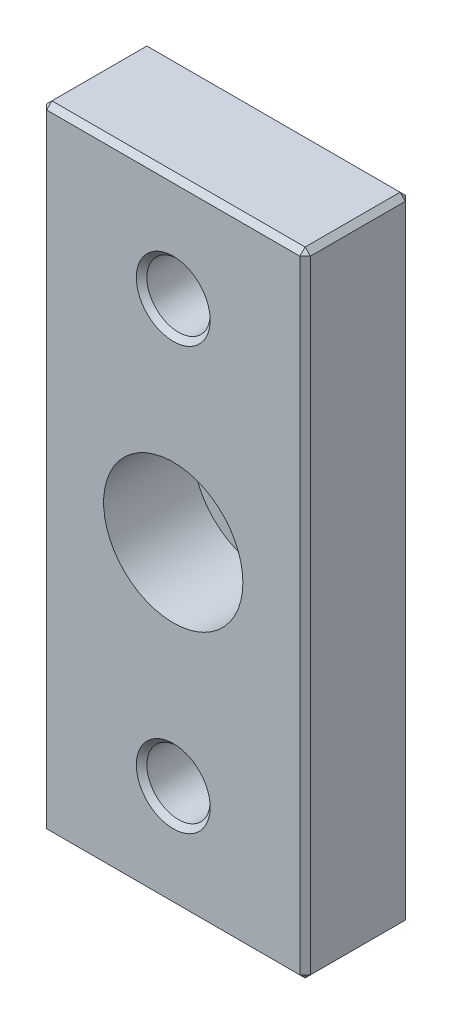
ISO-10303-21;
HEADER;
FILE_DESCRIPTION(('STEP AP214'),'2;1');
FILE_NAME('part.step','',(''),(''),'','','');
FILE_SCHEMA(('AUTOMOTIVE_DESIGN { 1 0 10303 214 1 1 1 1 }'));
ENDSEC;
DATA;
#1=APPLICATION_CONTEXT('core data for automotive mechanical design processes');
#2=APPLICATION_PROTOCOL_DEFINITION('international standard','automotive_design',2000,#1);
#3=PRODUCT_CONTEXT('',#1,'mechanical');
#4=PRODUCT('Part','Part','',(#3));
#5=PRODUCT_RELATED_PRODUCT_CATEGORY('part','',(#4));
#6=PRODUCT_DEFINITION_FORMATION('','',#4);
#7=PRODUCT_DEFINITION_CONTEXT('part definition',#1,'design');
#8=PRODUCT_DEFINITION('design','',#6,#7);
#9=PRODUCT_DEFINITION_SHAPE('','',#8);
#10=(LENGTH_UNIT() NAMED_UNIT(*) SI_UNIT(.MILLI.,.METRE.));
#11=(NAMED_UNIT(*) PLANE_ANGLE_UNIT() SI_UNIT($,.RADIAN.));
#12=(NAMED_UNIT(*) SI_UNIT($,.STERADIAN.) SOLID_ANGLE_UNIT());
#13=UNCERTAINTY_MEASURE_WITH_UNIT(LENGTH_MEASURE(1.E-05),#10,'distance_accuracy_value','');
#14=(GEOMETRIC_REPRESENTATION_CONTEXT(3) GLOBAL_UNCERTAINTY_ASSIGNED_CONTEXT((#13)) GLOBAL_UNIT_ASSIGNED_CONTEXT((#10,
#11,#12)) REPRESENTATION_CONTEXT('',''));
#15=CARTESIAN_POINT('',(0.,0.,0.));
#16=DIRECTION('',(0.,0.,1.));
#17=DIRECTION('',(1.,0.,0.));
#18=AXIS2_PLACEMENT_3D('',#15,#16,#17);
#19=CARTESIAN_POINT('',(12.5,30.,10.));
#20=DIRECTION('',(0.,0.,-1.));
#21=DIRECTION('',(-1.,0.,0.));
#22=AXIS2_PLACEMENT_3D('',#19,#20,#21);
#23=CYLINDRICAL_SURFACE('',#22,4.1);
#24=CARTESIAN_POINT('',(12.5,30.,0.));
#25=DIRECTION('',(0.,0.,1.));
#26=DIRECTION('',(1.,0.,0.));
#27=AXIS2_PLACEMENT_3D('',#24,#25,#26);
#28=CIRCLE('',#27,4.1);
#29=CARTESIAN_POINT('',(16.6,30.,0.));
#30=VERTEX_POINT('',#29);
#31=EDGE_CURVE('E198',#30,#30,#28,.T.);
#32=ORIENTED_EDGE('',*,*,#31,.F.);
#33=EDGE_LOOP('',(#32));
#34=FACE_BOUND('',#33,.T.);
#35=CARTESIAN_POINT('',(12.5,30.,1.5));
#36=DIRECTION('',(0.,0.,1.));
#37=DIRECTION('',(1.,0.,0.));
#38=AXIS2_PLACEMENT_3D('',#35,#36,#37);
#39=CIRCLE('',#38,4.1);
#40=CARTESIAN_POINT('',(16.6,30.,1.5));
#41=VERTEX_POINT('',#40);
#42=EDGE_CURVE('E35',#41,#41,#39,.T.);
#43=ORIENTED_EDGE('',*,*,#42,.T.);
#44=EDGE_LOOP('',(#43));
#45=FACE_BOUND('',#44,.T.);
#46=ADVANCED_FACE('F31',(#34,#45),#23,.F.);
#47=CARTESIAN_POINT('',(0.,60.,10.));
#48=DIRECTION('',(0.,0.,1.));
#49=DIRECTION('',(1.,0.,0.));
#50=AXIS2_PLACEMENT_3D('',#47,#48,#49);
#51=PLANE('',#50);
#52=CARTESIAN_POINT('',(12.5,30.,10.));
#53=DIRECTION('',(0.,0.,1.));
#54=DIRECTION('',(1.,0.,0.));
#55=AXIS2_PLACEMENT_3D('',#52,#53,#54);
#56=CIRCLE('',#55,6.6);
#57=CARTESIAN_POINT('',(19.1,30.,10.));
#58=VERTEX_POINT('',#57);
#59=EDGE_CURVE('E358',#58,#58,#56,.T.);
#60=ORIENTED_EDGE('',*,*,#59,.F.);
#61=EDGE_LOOP('',(#60));
#62=FACE_BOUND('',#61,.T.);
#63=CARTESIAN_POINT('',(12.5,50.,10.));
#64=DIRECTION('',(0.,0.,1.));
#65=DIRECTION('',(1.,0.,0.));
#66=AXIS2_PLACEMENT_3D('',#63,#64,#65);
#67=CIRCLE('',#66,3.5);
#68=CARTESIAN_POINT('',(16.,50.,10.));
#69=VERTEX_POINT('',#68);
#70=EDGE_CURVE('E252',#69,#69,#67,.F.);
#71=ORIENTED_EDGE('',*,*,#70,.T.);
#72=EDGE_LOOP('',(#71));
#73=FACE_BOUND('',#72,.T.);
#74=DIRECTION('',(0.,1.,0.));
#75=VECTOR('',#74,1.);
#76=CARTESIAN_POINT('',(24.5,60.,10.));
#77=LINE('',#76,#75);
#78=CARTESIAN_POINT('',(24.5,0.500000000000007,10.));
#79=VERTEX_POINT('',#78);
#80=CARTESIAN_POINT('',(24.5,59.5,10.));
#81=VERTEX_POINT('',#80);
#82=EDGE_CURVE('E47',#79,#81,#77,.T.);
#83=ORIENTED_EDGE('',*,*,#82,.T.);
#84=DIRECTION('',(-1.,0.,0.));
#85=VECTOR('',#84,1.);
#86=CARTESIAN_POINT('',(0.,59.5,10.));
#87=LINE('',#86,#85);
#88=CARTESIAN_POINT('',(0.500000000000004,59.5,10.));
#89=VERTEX_POINT('',#88);
#90=EDGE_CURVE('E250',#81,#89,#87,.T.);
#91=ORIENTED_EDGE('',*,*,#90,.T.);
#92=DIRECTION('',(0.,-1.,0.));
#93=VECTOR('',#92,1.);
#94=CARTESIAN_POINT('',(0.500000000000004,60.,10.));
#95=LINE('',#94,#93);
#96=CARTESIAN_POINT('',(0.500000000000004,0.500000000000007,10.));
#97=VERTEX_POINT('',#96);
#98=EDGE_CURVE('E246',#89,#97,#95,.T.);
#99=ORIENTED_EDGE('',*,*,#98,.T.);
#100=DIRECTION('',(1.,0.,0.));
#101=VECTOR('',#100,1.);
#102=CARTESIAN_POINT('',(25.,0.500000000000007,10.));
#103=LINE('',#102,#101);
#104=EDGE_CURVE('E52',#97,#79,#103,.T.);
#105=ORIENTED_EDGE('',*,*,#104,.T.);
#106=EDGE_LOOP('',(#83,#91,#99,#105));
#107=FACE_BOUND('',#106,.T.);
#108=CARTESIAN_POINT('',(12.5,9.99999999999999,10.));
#109=DIRECTION('',(0.,0.,1.));
#110=DIRECTION('',(1.,0.,0.));
#111=AXIS2_PLACEMENT_3D('',#108,#109,#110);
#112=CIRCLE('',#111,3.5);
#113=CARTESIAN_POINT('',(16.,9.99999999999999,10.));
#114=VERTEX_POINT('',#113);
#115=EDGE_CURVE('E243',#114,#114,#112,.F.);
#116=ORIENTED_EDGE('',*,*,#115,.T.);
#117=EDGE_LOOP('',(#116));
#118=FACE_BOUND('',#117,.T.);
#119=ADVANCED_FACE('F280',(#62,#73,#107,#118),#51,.T.);
#120=CARTESIAN_POINT('',(0.,60.,0.));
#121=DIRECTION('',(0.,0.,1.));
#122=DIRECTION('',(1.,0.,0.));
#123=AXIS2_PLACEMENT_3D('',#120,#121,#122);
#124=PLANE('',#123);
#125=DIRECTION('',(0.,-1.,0.));
#126=VECTOR('',#125,1.);
#127=CARTESIAN_POINT('',(24.5,0.,0.));
#128=LINE('',#127,#126);
#129=CARTESIAN_POINT('',(24.5,59.5,0.));
#130=VERTEX_POINT('',#129);
#131=CARTESIAN_POINT('',(24.5,0.5,0.));
#132=VERTEX_POINT('',#131);
#133=EDGE_CURVE('E210',#130,#132,#128,.T.);
#134=ORIENTED_EDGE('',*,*,#133,.T.);
#135=DIRECTION('',(-1.,0.,0.));
#136=VECTOR('',#135,1.);
#137=CARTESIAN_POINT('',(0.,0.5,0.));
#138=LINE('',#137,#136);
#139=CARTESIAN_POINT('',(0.500000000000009,0.5,0.));
#140=VERTEX_POINT('',#139);
#141=EDGE_CURVE('E214',#132,#140,#138,.T.);
#142=ORIENTED_EDGE('',*,*,#141,.T.);
#143=DIRECTION('',(0.,1.,0.));
#144=VECTOR('',#143,1.);
#145=CARTESIAN_POINT('',(0.500000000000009,60.,0.));
#146=LINE('',#145,#144);
#147=CARTESIAN_POINT('',(0.500000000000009,59.5,0.));
#148=VERTEX_POINT('',#147);
#149=EDGE_CURVE('E212',#140,#148,#146,.T.);
#150=ORIENTED_EDGE('',*,*,#149,.T.);
#151=DIRECTION('',(1.,0.,0.));
#152=VECTOR('',#151,1.);
#153=CARTESIAN_POINT('',(0.,59.5,0.));
#154=LINE('',#153,#152);
#155=EDGE_CURVE('E208',#148,#130,#154,.T.);
#156=ORIENTED_EDGE('',*,*,#155,.T.);
#157=EDGE_LOOP('',(#134,#142,#150,#156));
#158=FACE_BOUND('',#157,.T.);
#159=CARTESIAN_POINT('',(12.5,9.99999999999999,0.));
#160=DIRECTION('',(0.,0.,1.));
#161=DIRECTION('',(1.,0.,0.));
#162=AXIS2_PLACEMENT_3D('',#159,#160,#161);
#163=CIRCLE('',#162,3.);
#164=CARTESIAN_POINT('',(15.5,9.99999999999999,0.));
#165=VERTEX_POINT('',#164);
#166=EDGE_CURVE('E201',#165,#165,#163,.T.);
#167=ORIENTED_EDGE('',*,*,#166,.T.);
#168=EDGE_LOOP('',(#167));
#169=FACE_BOUND('',#168,.T.);
#170=CARTESIAN_POINT('',(12.5,50.,0.));
#171=DIRECTION('',(0.,0.,1.));
#172=DIRECTION('',(1.,0.,0.));
#173=AXIS2_PLACEMENT_3D('',#170,#171,#172);
#174=CIRCLE('',#173,3.);
#175=CARTESIAN_POINT('',(15.5,50.,0.));
#176=VERTEX_POINT('',#175);
#177=EDGE_CURVE('E140',#176,#176,#174,.T.);
#178=ORIENTED_EDGE('',*,*,#177,.T.);
#179=EDGE_LOOP('',(#178));
#180=FACE_BOUND('',#179,.T.);
#181=ORIENTED_EDGE('',*,*,#31,.T.);
#182=EDGE_LOOP('',(#181));
#183=FACE_BOUND('',#182,.T.);
#184=ADVANCED_FACE('F286',(#158,#169,#180,#183),#124,.F.);
#185=CARTESIAN_POINT('',(0.,0.,10.));
#186=DIRECTION('',(-1.,0.,0.));
#187=DIRECTION('',(0.,0.,1.));
#188=AXIS2_PLACEMENT_3D('',#185,#186,#187);
#189=PLANE('',#188);
#190=DIRECTION('',(0.,0.,-1.));
#191=VECTOR('',#190,1.);
#192=CARTESIAN_POINT('',(0.,59.5,0.));
#193=LINE('',#192,#191);
#194=CARTESIAN_POINT('',(0.,59.5,9.49999999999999));
#195=VERTEX_POINT('',#194);
#196=CARTESIAN_POINT('',(0.,59.5,0.500000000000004));
#197=VERTEX_POINT('',#196);
#198=EDGE_CURVE('E221',#195,#197,#193,.T.);
#199=ORIENTED_EDGE('',*,*,#198,.T.);
#200=DIRECTION('',(0.,-1.,0.));
#201=VECTOR('',#200,1.);
#202=CARTESIAN_POINT('',(0.,0.,0.500000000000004));
#203=LINE('',#202,#201);
#204=CARTESIAN_POINT('',(0.,0.500000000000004,0.500000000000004));
#205=VERTEX_POINT('',#204);
#206=EDGE_CURVE('E223',#197,#205,#203,.T.);
#207=ORIENTED_EDGE('',*,*,#206,.T.);
#208=DIRECTION('',(0.,0.,1.));
#209=VECTOR('',#208,1.);
#210=CARTESIAN_POINT('',(0.,0.500000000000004,10.));
#211=LINE('',#210,#209);
#212=CARTESIAN_POINT('',(0.,0.500000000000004,9.49999999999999));
#213=VERTEX_POINT('',#212);
#214=EDGE_CURVE('E219',#205,#213,#211,.T.);
#215=ORIENTED_EDGE('',*,*,#214,.T.);
#216=DIRECTION('',(0.,1.,0.));
#217=VECTOR('',#216,1.);
#218=CARTESIAN_POINT('',(0.,0.,9.49999999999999));
#219=LINE('',#218,#217);
#220=EDGE_CURVE('E217',#213,#195,#219,.T.);
#221=ORIENTED_EDGE('',*,*,#220,.T.);
#222=EDGE_LOOP('',(#199,#207,#215,#221));
#223=FACE_BOUND('',#222,.T.);
#224=ADVANCED_FACE('F303',(#223),#189,.T.);
#225=CARTESIAN_POINT('',(0.,0.,10.));
#226=DIRECTION('',(0.,1.,0.));
#227=DIRECTION('',(0.,0.,1.));
#228=AXIS2_PLACEMENT_3D('',#225,#226,#227);
#229=PLANE('',#228);
#230=DIRECTION('',(0.,0.,-1.));
#231=VECTOR('',#230,1.);
#232=CARTESIAN_POINT('',(0.500000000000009,0.,0.));
#233=LINE('',#232,#231);
#234=CARTESIAN_POINT('',(0.500000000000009,0.,9.5));
#235=VERTEX_POINT('',#234);
#236=CARTESIAN_POINT('',(0.500000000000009,0.,0.500000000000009));
#237=VERTEX_POINT('',#236);
#238=EDGE_CURVE('E129',#235,#237,#233,.T.);
#239=ORIENTED_EDGE('',*,*,#238,.T.);
#240=DIRECTION('',(1.,0.,0.));
#241=VECTOR('',#240,1.);
#242=CARTESIAN_POINT('',(0.,0.,0.500000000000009));
#243=LINE('',#242,#241);
#244=CARTESIAN_POINT('',(24.5,0.,0.500000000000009));
#245=VERTEX_POINT('',#244);
#246=EDGE_CURVE('E125',#237,#245,#243,.T.);
#247=ORIENTED_EDGE('',*,*,#246,.T.);
#248=DIRECTION('',(0.,0.,1.));
#249=VECTOR('',#248,1.);
#250=CARTESIAN_POINT('',(24.5,0.,10.));
#251=LINE('',#250,#249);
#252=CARTESIAN_POINT('',(24.5,0.,9.5));
#253=VERTEX_POINT('',#252);
#254=EDGE_CURVE('E120',#245,#253,#251,.T.);
#255=ORIENTED_EDGE('',*,*,#254,.T.);
#256=DIRECTION('',(-1.,0.,0.));
#257=VECTOR('',#256,1.);
#258=CARTESIAN_POINT('',(0.,0.,9.5));
#259=LINE('',#258,#257);
#260=EDGE_CURVE('E122',#253,#235,#259,.T.);
#261=ORIENTED_EDGE('',*,*,#260,.T.);
#262=EDGE_LOOP('',(#239,#247,#255,#261));
#263=FACE_BOUND('',#262,.T.);
#264=ADVANCED_FACE('F33',(#263),#229,.F.);
#265=CARTESIAN_POINT('',(25.,60.,10.));
#266=DIRECTION('',(1.,0.,0.));
#267=DIRECTION('',(0.,1.,0.));
#268=AXIS2_PLACEMENT_3D('',#265,#266,#267);
#269=PLANE('',#268);
#270=DIRECTION('',(0.,0.,-1.));
#271=VECTOR('',#270,1.);
#272=CARTESIAN_POINT('',(25.,0.500000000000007,0.));
#273=LINE('',#272,#271);
#274=CARTESIAN_POINT('',(25.,0.500000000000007,9.49999999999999));
#275=VERTEX_POINT('',#274);
#276=CARTESIAN_POINT('',(25.,0.500000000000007,0.500000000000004));
#277=VERTEX_POINT('',#276);
#278=EDGE_CURVE('E151',#275,#277,#273,.T.);
#279=ORIENTED_EDGE('',*,*,#278,.T.);
#280=DIRECTION('',(0.,1.,0.));
#281=VECTOR('',#280,1.);
#282=CARTESIAN_POINT('',(25.,60.,0.500000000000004));
#283=LINE('',#282,#281);
#284=CARTESIAN_POINT('',(25.,59.5,0.500000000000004));
#285=VERTEX_POINT('',#284);
#286=EDGE_CURVE('E240',#277,#285,#283,.T.);
#287=ORIENTED_EDGE('',*,*,#286,.T.);
#288=DIRECTION('',(0.,0.,1.));
#289=VECTOR('',#288,1.);
#290=CARTESIAN_POINT('',(25.,59.5,10.));
#291=LINE('',#290,#289);
#292=CARTESIAN_POINT('',(25.,59.5,9.49999999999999));
#293=VERTEX_POINT('',#292);
#294=EDGE_CURVE('E237',#285,#293,#291,.T.);
#295=ORIENTED_EDGE('',*,*,#294,.T.);
#296=DIRECTION('',(0.,-1.,0.));
#297=VECTOR('',#296,1.);
#298=CARTESIAN_POINT('',(25.,60.,9.49999999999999));
#299=LINE('',#298,#297);
#300=EDGE_CURVE('E235',#293,#275,#299,.T.);
#301=ORIENTED_EDGE('',*,*,#300,.T.);
#302=EDGE_LOOP('',(#279,#287,#295,#301));
#303=FACE_BOUND('',#302,.T.);
#304=ADVANCED_FACE('F310',(#303),#269,.T.);
#305=CARTESIAN_POINT('',(25.,60.,10.));
#306=DIRECTION('',(0.,-1.,0.));
#307=DIRECTION('',(0.,0.,-1.));
#308=AXIS2_PLACEMENT_3D('',#305,#306,#307);
#309=PLANE('',#308);
#310=DIRECTION('',(0.,0.,1.));
#311=VECTOR('',#310,1.);
#312=CARTESIAN_POINT('',(0.500000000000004,60.,10.));
#313=LINE('',#312,#311);
#314=CARTESIAN_POINT('',(0.500000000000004,60.,0.500000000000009));
#315=VERTEX_POINT('',#314);
#316=CARTESIAN_POINT('',(0.500000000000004,60.,9.5));
#317=VERTEX_POINT('',#316);
#318=EDGE_CURVE('E230',#315,#317,#313,.T.);
#319=ORIENTED_EDGE('',*,*,#318,.T.);
#320=DIRECTION('',(1.,0.,0.));
#321=VECTOR('',#320,1.);
#322=CARTESIAN_POINT('',(25.,60.,9.5));
#323=LINE('',#322,#321);
#324=CARTESIAN_POINT('',(24.5,60.,9.5));
#325=VERTEX_POINT('',#324);
#326=EDGE_CURVE('E233',#317,#325,#323,.T.);
#327=ORIENTED_EDGE('',*,*,#326,.T.);
#328=DIRECTION('',(0.,0.,-1.));
#329=VECTOR('',#328,1.);
#330=CARTESIAN_POINT('',(24.5,60.,0.));
#331=LINE('',#330,#329);
#332=CARTESIAN_POINT('',(24.5,60.,0.500000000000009));
#333=VERTEX_POINT('',#332);
#334=EDGE_CURVE('E228',#325,#333,#331,.T.);
#335=ORIENTED_EDGE('',*,*,#334,.T.);
#336=DIRECTION('',(-1.,0.,0.));
#337=VECTOR('',#336,1.);
#338=CARTESIAN_POINT('',(25.,60.,0.500000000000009));
#339=LINE('',#338,#337);
#340=EDGE_CURVE('E226',#333,#315,#339,.T.);
#341=ORIENTED_EDGE('',*,*,#340,.T.);
#342=EDGE_LOOP('',(#319,#327,#335,#341));
#343=FACE_BOUND('',#342,.T.);
#344=ADVANCED_FACE('F301',(#343),#309,.F.);
#345=CARTESIAN_POINT('',(12.5,50.,10.));
#346=DIRECTION('',(0.,0.,-1.));
#347=DIRECTION('',(-1.,0.,0.));
#348=AXIS2_PLACEMENT_3D('',#345,#346,#347);
#349=CYLINDRICAL_SURFACE('',#348,3.);
#350=CARTESIAN_POINT('',(12.5,50.,9.49999999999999));
#351=DIRECTION('',(0.,0.,1.));
#352=DIRECTION('',(1.,0.,0.));
#353=AXIS2_PLACEMENT_3D('',#350,#351,#352);
#354=CIRCLE('',#353,3.);
#355=CARTESIAN_POINT('',(15.5,50.,9.49999999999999));
#356=VERTEX_POINT('',#355);
#357=EDGE_CURVE('E40',#356,#356,#354,.T.);
#358=ORIENTED_EDGE('',*,*,#357,.T.);
#359=EDGE_LOOP('',(#358));
#360=FACE_BOUND('',#359,.T.);
#361=ORIENTED_EDGE('',*,*,#177,.F.);
#362=EDGE_LOOP('',(#361));
#363=FACE_BOUND('',#362,.T.);
#364=ADVANCED_FACE('F258',(#360,#363),#349,.F.);
#365=CARTESIAN_POINT('',(12.5,9.99999999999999,10.));
#366=DIRECTION('',(0.,0.,-1.));
#367=DIRECTION('',(-1.,0.,0.));
#368=AXIS2_PLACEMENT_3D('',#365,#366,#367);
#369=CYLINDRICAL_SURFACE('',#368,3.);
#370=CARTESIAN_POINT('',(12.5,9.99999999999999,9.49999999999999));
#371=DIRECTION('',(0.,0.,1.));
#372=DIRECTION('',(1.,0.,0.));
#373=AXIS2_PLACEMENT_3D('',#370,#371,#372);
#374=CIRCLE('',#373,3.);
#375=CARTESIAN_POINT('',(15.5,9.99999999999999,9.49999999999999));
#376=VERTEX_POINT('',#375);
#377=EDGE_CURVE('E11',#376,#376,#374,.T.);
#378=ORIENTED_EDGE('',*,*,#377,.T.);
#379=EDGE_LOOP('',(#378));
#380=FACE_BOUND('',#379,.T.);
#381=ORIENTED_EDGE('',*,*,#166,.F.);
#382=EDGE_LOOP('',(#381));
#383=FACE_BOUND('',#382,.T.);
#384=ADVANCED_FACE('F295',(#380,#383),#369,.F.);
#385=CARTESIAN_POINT('',(0.,59.5,10.));
#386=DIRECTION('',(0.,0.707106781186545,0.70710678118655));
#387=DIRECTION('',(0.,-0.70710678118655,0.707106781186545));
#388=AXIS2_PLACEMENT_3D('',#385,#386,#387);
#389=PLANE('',#388);
#390=DIRECTION('',(0.,0.70710678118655,-0.707106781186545));
#391=VECTOR('',#390,1.);
#392=CARTESIAN_POINT('',(0.500000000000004,60.,9.5));
#393=LINE('',#392,#391);
#394=EDGE_CURVE('E195',#89,#317,#393,.T.);
#395=ORIENTED_EDGE('',*,*,#394,.F.);
#396=ORIENTED_EDGE('',*,*,#90,.F.);
#397=DIRECTION('',(0.,-0.70710678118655,0.707106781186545));
#398=VECTOR('',#397,1.);
#399=CARTESIAN_POINT('',(24.5,59.75,9.74999999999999));
#400=LINE('',#399,#398);
#401=EDGE_CURVE('E192',#325,#81,#400,.T.);
#402=ORIENTED_EDGE('',*,*,#401,.F.);
#403=ORIENTED_EDGE('',*,*,#326,.F.);
#404=EDGE_LOOP('',(#395,#396,#402,#403));
#405=FACE_BOUND('',#404,.T.);
#406=ADVANCED_FACE('F293',(#405),#389,.T.);
#407=CARTESIAN_POINT('',(0.500000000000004,60.,9.5));
#408=DIRECTION('',(-0.577350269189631,0.577350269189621,0.577350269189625));
#409=DIRECTION('',(0.707106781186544,0.,0.707106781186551));
#410=AXIS2_PLACEMENT_3D('',#407,#408,#409);
#411=PLANE('',#410);
#412=DIRECTION('',(-0.707106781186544,0.,-0.707106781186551));
#413=VECTOR('',#412,1.);
#414=CARTESIAN_POINT('',(0.250000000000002,59.5,9.74999999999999));
#415=LINE('',#414,#413);
#416=EDGE_CURVE('E187',#89,#195,#415,.T.);
#417=ORIENTED_EDGE('',*,*,#416,.F.);
#418=ORIENTED_EDGE('',*,*,#394,.T.);
#419=DIRECTION('',(-0.707106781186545,-0.70710678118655,0.));
#420=VECTOR('',#419,1.);
#421=CARTESIAN_POINT('',(0.500000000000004,60.,9.5));
#422=LINE('',#421,#420);
#423=EDGE_CURVE('E190',#195,#317,#422,.F.);
#424=ORIENTED_EDGE('',*,*,#423,.F.);
#425=EDGE_LOOP('',(#417,#418,#424));
#426=FACE_BOUND('',#425,.T.);
#427=ADVANCED_FACE('F562',(#426),#411,.T.);
#428=CARTESIAN_POINT('',(25.,59.5,9.49999999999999));
#429=DIRECTION('',(0.577350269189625,0.577350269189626,0.577350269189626));
#430=DIRECTION('',(0.,-0.707106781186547,0.707106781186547));
#431=AXIS2_PLACEMENT_3D('',#428,#429,#430);
#432=PLANE('',#431);
#433=DIRECTION('',(-0.707106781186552,0.707106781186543,0.));
#434=VECTOR('',#433,1.);
#435=CARTESIAN_POINT('',(25.,59.5,9.49999999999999));
#436=LINE('',#435,#434);
#437=EDGE_CURVE('E181',#325,#293,#436,.F.);
#438=ORIENTED_EDGE('',*,*,#437,.F.);
#439=ORIENTED_EDGE('',*,*,#401,.T.);
#440=DIRECTION('',(-0.707106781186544,0.,0.707106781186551));
#441=VECTOR('',#440,1.);
#442=CARTESIAN_POINT('',(25.,59.5,9.49999999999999));
#443=LINE('',#442,#441);
#444=EDGE_CURVE('E184',#293,#81,#443,.T.);
#445=ORIENTED_EDGE('',*,*,#444,.F.);
#446=EDGE_LOOP('',(#438,#439,#445));
#447=FACE_BOUND('',#446,.T.);
#448=ADVANCED_FACE('F552',(#447),#432,.T.);
#449=CARTESIAN_POINT('',(0.,59.5,10.));
#450=DIRECTION('',(-0.70710678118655,0.707106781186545,0.));
#451=DIRECTION('',(-0.707106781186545,-0.70710678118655,0.));
#452=AXIS2_PLACEMENT_3D('',#449,#450,#451);
#453=PLANE('',#452);
#454=ORIENTED_EDGE('',*,*,#423,.T.);
#455=ORIENTED_EDGE('',*,*,#318,.F.);
#456=DIRECTION('',(0.707106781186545,0.70710678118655,0.));
#457=VECTOR('',#456,1.);
#458=CARTESIAN_POINT('',(0.250000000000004,59.75,0.500000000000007));
#459=LINE('',#458,#457);
#460=EDGE_CURVE('E175',#197,#315,#459,.T.);
#461=ORIENTED_EDGE('',*,*,#460,.F.);
#462=ORIENTED_EDGE('',*,*,#198,.F.);
#463=EDGE_LOOP('',(#454,#455,#461,#462));
#464=FACE_BOUND('',#463,.T.);
#465=ADVANCED_FACE('F542',(#464),#453,.T.);
#466=CARTESIAN_POINT('',(0.,0.,9.49999999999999));
#467=DIRECTION('',(0.707106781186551,0.,-0.707106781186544));
#468=DIRECTION('',(-0.707106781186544,0.,-0.707106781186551));
#469=AXIS2_PLACEMENT_3D('',#466,#467,#468);
#470=PLANE('',#469);
#471=ORIENTED_EDGE('',*,*,#416,.T.);
#472=ORIENTED_EDGE('',*,*,#220,.F.);
#473=DIRECTION('',(0.707106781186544,0.,0.707106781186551));
#474=VECTOR('',#473,1.);
#475=CARTESIAN_POINT('',(0.,0.500000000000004,9.49999999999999));
#476=LINE('',#475,#474);
#477=EDGE_CURVE('E172',#97,#213,#476,.F.);
#478=ORIENTED_EDGE('',*,*,#477,.F.);
#479=ORIENTED_EDGE('',*,*,#98,.F.);
#480=EDGE_LOOP('',(#471,#472,#478,#479));
#481=FACE_BOUND('',#480,.T.);
#482=ADVANCED_FACE('F533',(#481),#470,.F.);
#483=CARTESIAN_POINT('',(0.,0.500000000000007,10.));
#484=DIRECTION('',(0.,-0.707106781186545,0.70710678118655));
#485=DIRECTION('',(0.,-0.70710678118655,-0.707106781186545));
#486=AXIS2_PLACEMENT_3D('',#483,#484,#485);
#487=PLANE('',#486);
#488=DIRECTION('',(0.,-0.70710678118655,-0.707106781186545));
#489=VECTOR('',#488,1.);
#490=CARTESIAN_POINT('',(24.5,0.,9.5));
#491=LINE('',#490,#489);
#492=EDGE_CURVE('E135',#79,#253,#491,.T.);
#493=ORIENTED_EDGE('',*,*,#492,.F.);
#494=ORIENTED_EDGE('',*,*,#104,.F.);
#495=DIRECTION('',(0.,0.70710678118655,0.707106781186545));
#496=VECTOR('',#495,1.);
#497=CARTESIAN_POINT('',(0.500000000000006,0.250000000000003,9.75));
#498=LINE('',#497,#496);
#499=EDGE_CURVE('E138',#235,#97,#498,.T.);
#500=ORIENTED_EDGE('',*,*,#499,.F.);
#501=ORIENTED_EDGE('',*,*,#260,.F.);
#502=EDGE_LOOP('',(#493,#494,#500,#501));
#503=FACE_BOUND('',#502,.T.);
#504=ADVANCED_FACE('F134',(#503),#487,.T.);
#505=CARTESIAN_POINT('',(25.,60.,9.49999999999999));
#506=DIRECTION('',(-0.707106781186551,0.,-0.707106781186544));
#507=DIRECTION('',(-0.707106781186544,0.,0.707106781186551));
#508=AXIS2_PLACEMENT_3D('',#505,#506,#507);
#509=PLANE('',#508);
#510=ORIENTED_EDGE('',*,*,#444,.T.);
#511=ORIENTED_EDGE('',*,*,#82,.F.);
#512=DIRECTION('',(0.707106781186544,0.,-0.707106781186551));
#513=VECTOR('',#512,1.);
#514=CARTESIAN_POINT('',(24.75,0.500000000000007,9.74999999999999));
#515=LINE('',#514,#513);
#516=EDGE_CURVE('E148',#275,#79,#515,.F.);
#517=ORIENTED_EDGE('',*,*,#516,.F.);
#518=ORIENTED_EDGE('',*,*,#300,.F.);
#519=EDGE_LOOP('',(#510,#511,#517,#518));
#520=FACE_BOUND('',#519,.T.);
#521=ADVANCED_FACE('F514',(#520),#509,.F.);
#522=CARTESIAN_POINT('',(24.5,60.,10.));
#523=DIRECTION('',(0.707106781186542,0.707106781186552,0.));
#524=DIRECTION('',(-0.707106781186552,0.707106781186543,0.));
#525=AXIS2_PLACEMENT_3D('',#522,#523,#524);
#526=PLANE('',#525);
#527=ORIENTED_EDGE('',*,*,#437,.T.);
#528=ORIENTED_EDGE('',*,*,#294,.F.);
#529=DIRECTION('',(0.707106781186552,-0.707106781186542,0.));
#530=VECTOR('',#529,1.);
#531=CARTESIAN_POINT('',(25.,59.5,0.500000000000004));
#532=LINE('',#531,#530);
#533=EDGE_CURVE('E167',#333,#285,#532,.T.);
#534=ORIENTED_EDGE('',*,*,#533,.F.);
#535=ORIENTED_EDGE('',*,*,#334,.F.);
#536=EDGE_LOOP('',(#527,#528,#534,#535));
#537=FACE_BOUND('',#536,.T.);
#538=ADVANCED_FACE('F504',(#537),#526,.T.);
#539=CARTESIAN_POINT('',(25.,60.,0.500000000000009));
#540=DIRECTION('',(0.,-0.707106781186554,0.707106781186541));
#541=DIRECTION('',(0.,-0.707106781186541,-0.707106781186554));
#542=AXIS2_PLACEMENT_3D('',#539,#540,#541);
#543=PLANE('',#542);
#544=DIRECTION('',(0.,0.707106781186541,0.707106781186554));
#545=VECTOR('',#544,1.);
#546=CARTESIAN_POINT('',(0.500000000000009,59.5,0.));
#547=LINE('',#546,#545);
#548=EDGE_CURVE('E178',#315,#148,#547,.F.);
#549=ORIENTED_EDGE('',*,*,#548,.F.);
#550=ORIENTED_EDGE('',*,*,#340,.F.);
#551=DIRECTION('',(0.,-0.707106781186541,-0.707106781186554));
#552=VECTOR('',#551,1.);
#553=CARTESIAN_POINT('',(24.5,59.75,0.250000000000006));
#554=LINE('',#553,#552);
#555=EDGE_CURVE('E164',#130,#333,#554,.F.);
#556=ORIENTED_EDGE('',*,*,#555,.F.);
#557=ORIENTED_EDGE('',*,*,#155,.F.);
#558=EDGE_LOOP('',(#549,#550,#556,#557));
#559=FACE_BOUND('',#558,.T.);
#560=ADVANCED_FACE('F494',(#559),#543,.F.);
#561=CARTESIAN_POINT('',(0.500000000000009,59.5,0.));
#562=DIRECTION('',(-0.577350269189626,0.577350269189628,-0.577350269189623));
#563=DIRECTION('',(-0.707106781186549,-0.707106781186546,0.));
#564=AXIS2_PLACEMENT_3D('',#561,#562,#563);
#565=PLANE('',#564);
#566=ORIENTED_EDGE('',*,*,#460,.T.);
#567=ORIENTED_EDGE('',*,*,#548,.T.);
#568=DIRECTION('',(-0.707106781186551,0.,0.707106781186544));
#569=VECTOR('',#568,1.);
#570=CARTESIAN_POINT('',(0.500000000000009,59.5,0.));
#571=LINE('',#570,#569);
#572=EDGE_CURVE('E156',#197,#148,#571,.F.);
#573=ORIENTED_EDGE('',*,*,#572,.F.);
#574=EDGE_LOOP('',(#566,#567,#573));
#575=FACE_BOUND('',#574,.T.);
#576=ADVANCED_FACE('F484',(#575),#565,.T.);
#577=CARTESIAN_POINT('',(0.,0.500000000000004,9.49999999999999));
#578=DIRECTION('',(-0.577350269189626,-0.577350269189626,0.577350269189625));
#579=DIRECTION('',(0.707106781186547,-0.707106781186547,0.));
#580=AXIS2_PLACEMENT_3D('',#577,#578,#579);
#581=PLANE('',#580);
#582=ORIENTED_EDGE('',*,*,#499,.T.);
#583=ORIENTED_EDGE('',*,*,#477,.T.);
#584=DIRECTION('',(0.707106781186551,-0.707106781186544,0.));
#585=VECTOR('',#584,1.);
#586=CARTESIAN_POINT('',(0.,0.500000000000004,9.49999999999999));
#587=LINE('',#586,#585);
#588=EDGE_CURVE('E152',#235,#213,#587,.F.);
#589=ORIENTED_EDGE('',*,*,#588,.F.);
#590=EDGE_LOOP('',(#582,#583,#589));
#591=FACE_BOUND('',#590,.T.);
#592=ADVANCED_FACE('F475',(#591),#581,.T.);
#593=CARTESIAN_POINT('',(24.5,0.,9.5));
#594=DIRECTION('',(0.577350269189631,-0.577350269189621,0.577350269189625));
#595=DIRECTION('',(0.707106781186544,0.,-0.707106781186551));
#596=AXIS2_PLACEMENT_3D('',#593,#594,#595);
#597=PLANE('',#596);
#598=ORIENTED_EDGE('',*,*,#516,.T.);
#599=ORIENTED_EDGE('',*,*,#492,.T.);
#600=DIRECTION('',(0.707106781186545,0.70710678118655,0.));
#601=VECTOR('',#600,1.);
#602=CARTESIAN_POINT('',(24.5,0.,9.5));
#603=LINE('',#602,#601);
#604=EDGE_CURVE('E145',#275,#253,#603,.F.);
#605=ORIENTED_EDGE('',*,*,#604,.F.);
#606=EDGE_LOOP('',(#598,#599,#605));
#607=FACE_BOUND('',#606,.T.);
#608=ADVANCED_FACE('F144',(#607),#597,.T.);
#609=CARTESIAN_POINT('',(25.,59.5,0.500000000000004));
#610=DIRECTION('',(0.57735026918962,0.577350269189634,-0.577350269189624));
#611=DIRECTION('',(0.,0.707106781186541,0.707106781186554));
#612=AXIS2_PLACEMENT_3D('',#609,#610,#611);
#613=PLANE('',#612);
#614=ORIENTED_EDGE('',*,*,#555,.T.);
#615=ORIENTED_EDGE('',*,*,#533,.T.);
#616=DIRECTION('',(-0.70710678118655,0.,-0.707106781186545));
#617=VECTOR('',#616,1.);
#618=CARTESIAN_POINT('',(25.,59.5,0.500000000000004));
#619=LINE('',#618,#617);
#620=EDGE_CURVE('E153',#130,#285,#619,.F.);
#621=ORIENTED_EDGE('',*,*,#620,.F.);
#622=EDGE_LOOP('',(#614,#615,#621));
#623=FACE_BOUND('',#622,.T.);
#624=ADVANCED_FACE('F457',(#623),#613,.T.);
#625=CARTESIAN_POINT('',(0.500000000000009,60.,0.));
#626=DIRECTION('',(-0.707106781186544,0.,-0.707106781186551));
#627=DIRECTION('',(-0.707106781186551,0.,0.707106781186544));
#628=AXIS2_PLACEMENT_3D('',#625,#626,#627);
#629=PLANE('',#628);
#630=ORIENTED_EDGE('',*,*,#572,.T.);
#631=ORIENTED_EDGE('',*,*,#149,.F.);
#632=DIRECTION('',(0.707106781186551,0.,-0.707106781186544));
#633=VECTOR('',#632,1.);
#634=CARTESIAN_POINT('',(0.500000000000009,0.5,0.));
#635=LINE('',#634,#633);
#636=EDGE_CURVE('E158',#205,#140,#635,.T.);
#637=ORIENTED_EDGE('',*,*,#636,.F.);
#638=ORIENTED_EDGE('',*,*,#206,.F.);
#639=EDGE_LOOP('',(#630,#631,#637,#638));
#640=FACE_BOUND('',#639,.T.);
#641=ADVANCED_FACE('F349',(#640),#629,.T.);
#642=CARTESIAN_POINT('',(0.500000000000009,0.,10.));
#643=DIRECTION('',(-0.707106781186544,-0.707106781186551,0.));
#644=DIRECTION('',(0.707106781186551,-0.707106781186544,0.));
#645=AXIS2_PLACEMENT_3D('',#642,#643,#644);
#646=PLANE('',#645);
#647=ORIENTED_EDGE('',*,*,#588,.T.);
#648=ORIENTED_EDGE('',*,*,#214,.F.);
#649=DIRECTION('',(-0.707106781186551,0.707106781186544,0.));
#650=VECTOR('',#649,1.);
#651=CARTESIAN_POINT('',(0.250000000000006,0.25,0.500000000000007));
#652=LINE('',#651,#650);
#653=EDGE_CURVE('E331',#237,#205,#652,.T.);
#654=ORIENTED_EDGE('',*,*,#653,.F.);
#655=ORIENTED_EDGE('',*,*,#238,.F.);
#656=EDGE_LOOP('',(#647,#648,#654,#655));
#657=FACE_BOUND('',#656,.T.);
#658=ADVANCED_FACE('F439',(#657),#646,.T.);
#659=CARTESIAN_POINT('',(25.,0.500000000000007,10.));
#660=DIRECTION('',(0.70710678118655,-0.707106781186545,0.));
#661=DIRECTION('',(0.707106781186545,0.70710678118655,0.));
#662=AXIS2_PLACEMENT_3D('',#659,#660,#661);
#663=PLANE('',#662);
#664=ORIENTED_EDGE('',*,*,#604,.T.);
#665=ORIENTED_EDGE('',*,*,#254,.F.);
#666=DIRECTION('',(-0.707106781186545,-0.70710678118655,0.));
#667=VECTOR('',#666,1.);
#668=CARTESIAN_POINT('',(24.5,0.,0.500000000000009));
#669=LINE('',#668,#667);
#670=EDGE_CURVE('E328',#277,#245,#669,.T.);
#671=ORIENTED_EDGE('',*,*,#670,.F.);
#672=ORIENTED_EDGE('',*,*,#278,.F.);
#673=EDGE_LOOP('',(#664,#665,#671,#672));
#674=FACE_BOUND('',#673,.T.);
#675=ADVANCED_FACE('F150',(#674),#663,.T.);
#676=CARTESIAN_POINT('',(24.5,60.,0.));
#677=DIRECTION('',(0.707106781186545,0.,-0.70710678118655));
#678=DIRECTION('',(-0.70710678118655,0.,-0.707106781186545));
#679=AXIS2_PLACEMENT_3D('',#676,#677,#678);
#680=PLANE('',#679);
#681=ORIENTED_EDGE('',*,*,#620,.T.);
#682=ORIENTED_EDGE('',*,*,#286,.F.);
#683=DIRECTION('',(0.70710678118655,0.,0.707106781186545));
#684=VECTOR('',#683,1.);
#685=CARTESIAN_POINT('',(24.75,0.500000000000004,0.250000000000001));
#686=LINE('',#685,#684);
#687=EDGE_CURVE('E324',#132,#277,#686,.T.);
#688=ORIENTED_EDGE('',*,*,#687,.F.);
#689=ORIENTED_EDGE('',*,*,#133,.F.);
#690=EDGE_LOOP('',(#681,#682,#688,#689));
#691=FACE_BOUND('',#690,.T.);
#692=ADVANCED_FACE('F321',(#691),#680,.T.);
#693=CARTESIAN_POINT('',(0.500000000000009,0.5,0.));
#694=DIRECTION('',(-0.577350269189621,-0.577350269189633,-0.577350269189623));
#695=DIRECTION('',(0.,0.707106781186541,-0.707106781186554));
#696=AXIS2_PLACEMENT_3D('',#693,#694,#695);
#697=PLANE('',#696);
#698=ORIENTED_EDGE('',*,*,#653,.T.);
#699=ORIENTED_EDGE('',*,*,#636,.T.);
#700=DIRECTION('',(0.,0.707106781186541,-0.707106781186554));
#701=VECTOR('',#700,1.);
#702=CARTESIAN_POINT('',(0.500000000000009,0.5,0.));
#703=LINE('',#702,#701);
#704=EDGE_CURVE('E334',#237,#140,#703,.T.);
#705=ORIENTED_EDGE('',*,*,#704,.F.);
#706=EDGE_LOOP('',(#698,#699,#705));
#707=FACE_BOUND('',#706,.T.);
#708=ADVANCED_FACE('F344',(#707),#697,.T.);
#709=CARTESIAN_POINT('',(24.5,0.,0.500000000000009));
#710=DIRECTION('',(0.577350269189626,-0.577350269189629,-0.577350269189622));
#711=DIRECTION('',(0.707106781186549,0.707106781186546,0.));
#712=AXIS2_PLACEMENT_3D('',#709,#710,#711);
#713=PLANE('',#712);
#714=ORIENTED_EDGE('',*,*,#687,.T.);
#715=ORIENTED_EDGE('',*,*,#670,.T.);
#716=DIRECTION('',(0.,-0.707106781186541,0.707106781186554));
#717=VECTOR('',#716,1.);
#718=CARTESIAN_POINT('',(24.5,0.,0.500000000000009));
#719=LINE('',#718,#717);
#720=EDGE_CURVE('E333',#132,#245,#719,.T.);
#721=ORIENTED_EDGE('',*,*,#720,.F.);
#722=EDGE_LOOP('',(#714,#715,#721));
#723=FACE_BOUND('',#722,.T.);
#724=ADVANCED_FACE('F275',(#723),#713,.T.);
#725=CARTESIAN_POINT('',(0.,0.,0.500000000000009));
#726=DIRECTION('',(0.,0.707106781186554,0.707106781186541));
#727=DIRECTION('',(0.,-0.707106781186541,0.707106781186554));
#728=AXIS2_PLACEMENT_3D('',#725,#726,#727);
#729=PLANE('',#728);
#730=ORIENTED_EDGE('',*,*,#704,.T.);
#731=ORIENTED_EDGE('',*,*,#141,.F.);
#732=ORIENTED_EDGE('',*,*,#720,.T.);
#733=ORIENTED_EDGE('',*,*,#246,.F.);
#734=EDGE_LOOP('',(#730,#731,#732,#733));
#735=FACE_BOUND('',#734,.T.);
#736=ADVANCED_FACE('F264',(#735),#729,.F.);
#737=CARTESIAN_POINT('',(12.5,50.,9.49999999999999));
#738=DIRECTION('',(0.,0.,1.));
#739=DIRECTION('',(1.,0.,0.));
#740=AXIS2_PLACEMENT_3D('',#737,#738,#739);
#741=CONICAL_SURFACE('',#740,3.,0.785398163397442);
#742=ORIENTED_EDGE('',*,*,#70,.F.);
#743=EDGE_LOOP('',(#742));
#744=FACE_BOUND('',#743,.T.);
#745=ORIENTED_EDGE('',*,*,#357,.F.);
#746=EDGE_LOOP('',(#745));
#747=FACE_BOUND('',#746,.T.);
#748=ADVANCED_FACE('F261',(#744,#747),#741,.F.);
#749=CARTESIAN_POINT('',(12.5,9.99999999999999,9.49999999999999));
#750=DIRECTION('',(0.,0.,1.));
#751=DIRECTION('',(1.,0.,0.));
#752=AXIS2_PLACEMENT_3D('',#749,#750,#751);
#753=CONICAL_SURFACE('',#752,3.,0.785398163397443);
#754=ORIENTED_EDGE('',*,*,#115,.F.);
#755=EDGE_LOOP('',(#754));
#756=FACE_BOUND('',#755,.T.);
#757=ORIENTED_EDGE('',*,*,#377,.F.);
#758=EDGE_LOOP('',(#757));
#759=FACE_BOUND('',#758,.T.);
#760=ADVANCED_FACE('F263',(#756,#759),#753,.F.);
#761=CARTESIAN_POINT('',(12.5,30.,1.5));
#762=DIRECTION('',(0.,0.,1.));
#763=DIRECTION('',(1.,0.,0.));
#764=AXIS2_PLACEMENT_3D('',#761,#762,#763);
#765=CYLINDRICAL_SURFACE('',#764,6.6);
#766=CARTESIAN_POINT('',(12.5,30.,1.5));
#767=DIRECTION('',(0.,0.,1.));
#768=DIRECTION('',(1.,0.,0.));
#769=AXIS2_PLACEMENT_3D('',#766,#767,#768);
#770=CIRCLE('',#769,6.6);
#771=CARTESIAN_POINT('',(19.1,30.,1.5));
#772=VERTEX_POINT('',#771);
#773=EDGE_CURVE('E354',#772,#772,#770,.T.);
#774=ORIENTED_EDGE('',*,*,#773,.F.);
#775=EDGE_LOOP('',(#774));
#776=FACE_BOUND('',#775,.T.);
#777=ORIENTED_EDGE('',*,*,#59,.T.);
#778=EDGE_LOOP('',(#777));
#779=FACE_BOUND('',#778,.T.);
#780=ADVANCED_FACE('F271',(#776,#779),#765,.F.);
#781=CARTESIAN_POINT('',(12.5,30.,1.5));
#782=DIRECTION('',(0.,0.,1.));
#783=DIRECTION('',(1.,0.,0.));
#784=AXIS2_PLACEMENT_3D('',#781,#782,#783);
#785=PLANE('',#784);
#786=ORIENTED_EDGE('',*,*,#42,.F.);
#787=EDGE_LOOP('',(#786));
#788=FACE_BOUND('',#787,.T.);
#789=ORIENTED_EDGE('',*,*,#773,.T.);
#790=EDGE_LOOP('',(#789));
#791=FACE_BOUND('',#790,.T.);
#792=ADVANCED_FACE('F274',(#788,#791),#785,.T.);
#793=CLOSED_SHELL('',(#46,#119,#184,#224,#264,#304,#344,#364,#384,#406,#427,#448,#465,#482,#504,
#521,#538,#560,#576,#592,#608,#624,#641,#658,#675,#692,#708,#724,#736,#748,#760,#780,#792));
#794=MANIFOLD_SOLID_BREP('B2',#793);
#795=ADVANCED_BREP_SHAPE_REPRESENTATION('',(#18,#794),#14);
#796=SHAPE_DEFINITION_REPRESENTATION(#9,#795);
ENDSEC;
END-ISO-10303-21;
